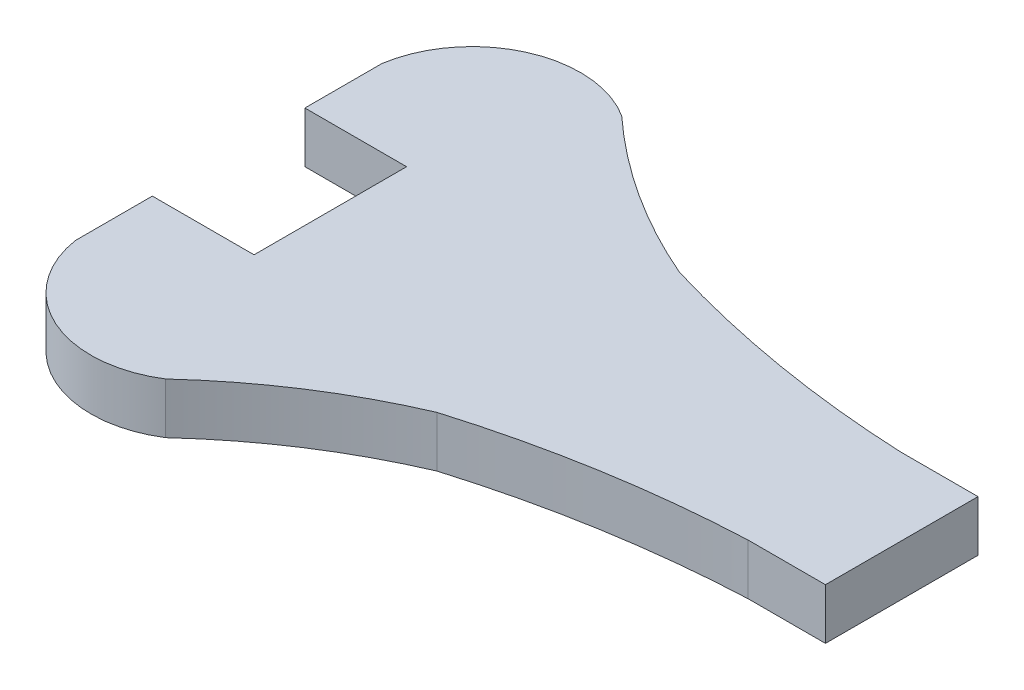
from build123d import *

# Parameters (mm, degrees)
SALIENTE_EXTRUIR1_DEPTH = 15


with BuildPart() as part:
    # Croquis1 → Saliente-Extruir1 (new body)
    with BuildSketch(Plane(origin=(0, 0, 0), x_dir=(1, 0, 0), z_dir=(0, 1, 0))):
        with BuildLine():
            Line((13846.050556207, 3171.602511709), (13846.050556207, 3194.313727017))
            ThreePointArc((13846.050556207, 3194.313727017), (13864.443170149, 3218.484086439), (13894.741430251, 3216.36042049))
            ThreePointArc((13894.741430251, 3216.36042049), (13917.683863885, 3198.556528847), (13943.301037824, 3184.878289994))
            ThreePointArc((13943.301037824, 3184.878289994), (13982.115778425, 3175.816849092), (14021.7507776, 3171.602511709))
            Line((14021.7507776, 3171.602511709), (14044.610454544, 3171.602511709))
            Line((14044.610454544, 3171.602511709), (14044.610454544, 3126.602511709))
            Line((14044.610454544, 3126.602511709), (14021.7507776, 3126.602511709))
            ThreePointArc((14021.7507776, 3126.602511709), (13982.115778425, 3122.388174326), (13943.301037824, 3113.326733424))
            ThreePointArc((13943.301037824, 3113.326733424), (13917.683863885, 3099.648494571), (13894.741430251, 3081.844602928))
            ThreePointArc((13894.741430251, 3081.844602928), (13864.443170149, 3079.720936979), (13846.050556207, 3103.891296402))
            Line((13846.050556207, 3103.891296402), (13846.050556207, 3126.602511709))
            Line((13846.050556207, 3126.602511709), (13876.050556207, 3126.602511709))
            Line((13876.050556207, 3126.602511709), (13876.050556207, 3149.102511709))
            Line((13876.050556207, 3149.102511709), (13876.050556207, 3171.602511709))
            Line((13876.050556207, 3171.602511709), (13846.050556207, 3171.602511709))
        make_face()
    extrude(amount=SALIENTE_EXTRUIR1_DEPTH)


solid = part.part
